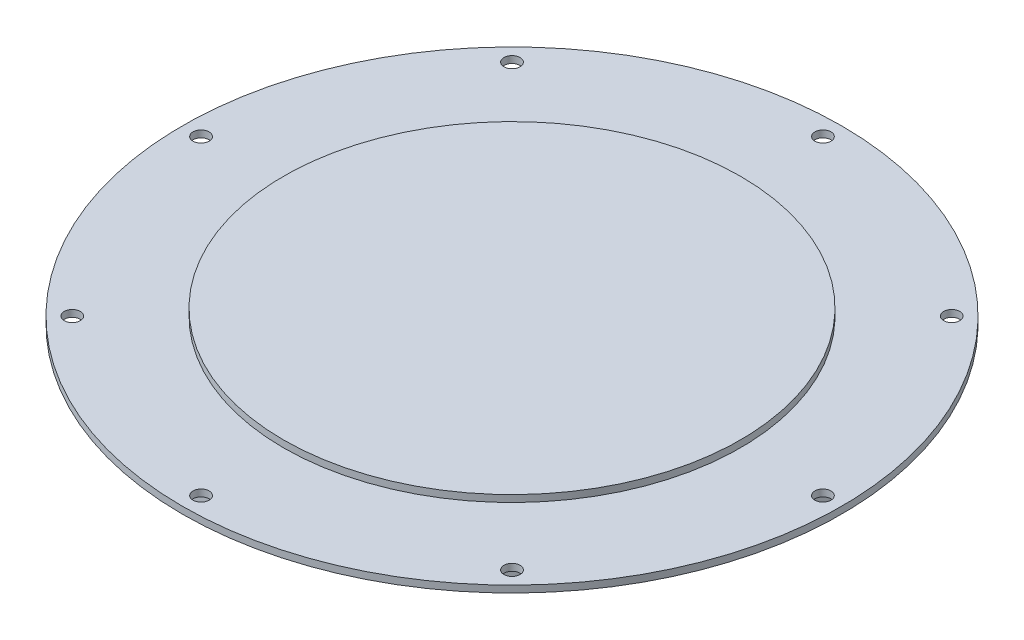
ISO-10303-21;
HEADER;
FILE_DESCRIPTION(('STEP AP214'),'2;1');
FILE_NAME('part.step','',(''),(''),'','','');
FILE_SCHEMA(('AUTOMOTIVE_DESIGN { 1 0 10303 214 1 1 1 1 }'));
ENDSEC;
DATA;
#1=APPLICATION_CONTEXT('core data for automotive mechanical design processes');
#2=APPLICATION_PROTOCOL_DEFINITION('international standard','automotive_design',2000,#1);
#3=PRODUCT_CONTEXT('',#1,'mechanical');
#4=PRODUCT('Part','Part','',(#3));
#5=PRODUCT_RELATED_PRODUCT_CATEGORY('part','',(#4));
#6=PRODUCT_DEFINITION_FORMATION('','',#4);
#7=PRODUCT_DEFINITION_CONTEXT('part definition',#1,'design');
#8=PRODUCT_DEFINITION('design','',#6,#7);
#9=PRODUCT_DEFINITION_SHAPE('','',#8);
#10=(LENGTH_UNIT() NAMED_UNIT(*) SI_UNIT(.MILLI.,.METRE.));
#11=(NAMED_UNIT(*) PLANE_ANGLE_UNIT() SI_UNIT($,.RADIAN.));
#12=(NAMED_UNIT(*) SI_UNIT($,.STERADIAN.) SOLID_ANGLE_UNIT());
#13=UNCERTAINTY_MEASURE_WITH_UNIT(LENGTH_MEASURE(1.E-05),#10,'distance_accuracy_value','');
#14=(GEOMETRIC_REPRESENTATION_CONTEXT(3) GLOBAL_UNCERTAINTY_ASSIGNED_CONTEXT((#13)) GLOBAL_UNIT_ASSIGNED_CONTEXT((#10,
#11,#12)) REPRESENTATION_CONTEXT('',''));
#15=CARTESIAN_POINT('',(0.,0.,0.));
#16=DIRECTION('',(0.,0.,1.));
#17=DIRECTION('',(1.,0.,0.));
#18=AXIS2_PLACEMENT_3D('',#15,#16,#17);
#19=CARTESIAN_POINT('',(0.,0.,0.));
#20=DIRECTION('',(0.,1.,0.));
#21=DIRECTION('',(0.,0.,1.));
#22=AXIS2_PLACEMENT_3D('',#19,#20,#21);
#23=CYLINDRICAL_SURFACE('',#22,146.05);
#24=CARTESIAN_POINT('',(0.,-3.048,0.));
#25=DIRECTION('',(0.,1.,0.));
#26=DIRECTION('',(0.,0.,1.));
#27=AXIS2_PLACEMENT_3D('',#24,#25,#26);
#28=CIRCLE('',#27,146.05);
#29=CARTESIAN_POINT('',(0.,-3.048,146.05));
#30=VERTEX_POINT('',#29);
#31=EDGE_CURVE('E112',#30,#30,#28,.T.);
#32=ORIENTED_EDGE('',*,*,#31,.T.);
#33=EDGE_LOOP('',(#32));
#34=FACE_BOUND('',#33,.T.);
#35=CARTESIAN_POINT('',(0.,0.,0.));
#36=DIRECTION('',(0.,1.,0.));
#37=DIRECTION('',(0.,0.,1.));
#38=AXIS2_PLACEMENT_3D('',#35,#36,#37);
#39=CIRCLE('',#38,146.05);
#40=CARTESIAN_POINT('',(0.,0.,146.05));
#41=VERTEX_POINT('',#40);
#42=EDGE_CURVE('E48',#41,#41,#39,.T.);
#43=ORIENTED_EDGE('',*,*,#42,.F.);
#44=EDGE_LOOP('',(#43));
#45=FACE_BOUND('',#44,.T.);
#46=ADVANCED_FACE('F35',(#34,#45),#23,.T.);
#47=CARTESIAN_POINT('',(-146.05,-3.048,0.));
#48=DIRECTION('',(0.,-1.,0.));
#49=DIRECTION('',(0.,0.,-1.));
#50=AXIS2_PLACEMENT_3D('',#47,#48,#49);
#51=PLANE('',#50);
#52=CARTESIAN_POINT('',(-97.4357789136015,-3.048,-97.4357789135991));
#53=DIRECTION('',(0.,-1.,0.));
#54=DIRECTION('',(0.,0.,-1.));
#55=AXIS2_PLACEMENT_3D('',#52,#53,#54);
#56=CIRCLE('',#55,3.571875);
#57=CARTESIAN_POINT('',(-97.4357789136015,-3.048,-101.007653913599));
#58=VERTEX_POINT('',#57);
#59=EDGE_CURVE('E84',#58,#58,#56,.T.);
#60=ORIENTED_EDGE('',*,*,#59,.F.);
#61=EDGE_LOOP('',(#60));
#62=FACE_BOUND('',#61,.T.);
#63=CARTESIAN_POINT('',(-1.44332601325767E-12,-3.048,-137.795));
#64=DIRECTION('',(0.,-1.,0.));
#65=DIRECTION('',(0.,0.,-1.));
#66=AXIS2_PLACEMENT_3D('',#63,#64,#65);
#67=CIRCLE('',#66,3.571875);
#68=CARTESIAN_POINT('',(-1.44332601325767E-12,-3.048,-141.366875));
#69=VERTEX_POINT('',#68);
#70=EDGE_CURVE('E74',#69,#69,#67,.T.);
#71=ORIENTED_EDGE('',*,*,#70,.F.);
#72=EDGE_LOOP('',(#71));
#73=FACE_BOUND('',#72,.T.);
#74=CARTESIAN_POINT('',(97.4357789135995,-3.048,-97.4357789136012));
#75=DIRECTION('',(0.,-1.,0.));
#76=DIRECTION('',(0.,0.,-1.));
#77=AXIS2_PLACEMENT_3D('',#74,#75,#76);
#78=CIRCLE('',#77,3.571875);
#79=CARTESIAN_POINT('',(97.4357789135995,-3.048,-101.007653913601));
#80=VERTEX_POINT('',#79);
#81=EDGE_CURVE('E71',#80,#80,#78,.T.);
#82=ORIENTED_EDGE('',*,*,#81,.F.);
#83=EDGE_LOOP('',(#82));
#84=FACE_BOUND('',#83,.T.);
#85=CARTESIAN_POINT('',(137.795,-3.048,0.));
#86=DIRECTION('',(0.,-1.,0.));
#87=DIRECTION('',(0.,0.,-1.));
#88=AXIS2_PLACEMENT_3D('',#85,#86,#87);
#89=CIRCLE('',#88,3.571875);
#90=CARTESIAN_POINT('',(137.795,-3.048,-3.571875));
#91=VERTEX_POINT('',#90);
#92=EDGE_CURVE('E68',#91,#91,#89,.T.);
#93=ORIENTED_EDGE('',*,*,#92,.F.);
#94=EDGE_LOOP('',(#93));
#95=FACE_BOUND('',#94,.T.);
#96=CARTESIAN_POINT('',(97.4357789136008,-3.048,97.4357789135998));
#97=DIRECTION('',(0.,-1.,0.));
#98=DIRECTION('',(0.,0.,-1.));
#99=AXIS2_PLACEMENT_3D('',#96,#97,#98);
#100=CIRCLE('',#99,3.571875);
#101=CARTESIAN_POINT('',(97.4357789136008,-3.048,93.8639039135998));
#102=VERTEX_POINT('',#101);
#103=EDGE_CURVE('E64',#102,#102,#100,.T.);
#104=ORIENTED_EDGE('',*,*,#103,.F.);
#105=EDGE_LOOP('',(#104));
#106=FACE_BOUND('',#105,.T.);
#107=CARTESIAN_POINT('',(4.8110867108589E-13,-3.048,137.795));
#108=DIRECTION('',(0.,-1.,0.));
#109=DIRECTION('',(0.,0.,-1.));
#110=AXIS2_PLACEMENT_3D('',#107,#108,#109);
#111=CIRCLE('',#110,3.571875);
#112=CARTESIAN_POINT('',(4.8110867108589E-13,-3.048,134.223125));
#113=VERTEX_POINT('',#112);
#114=EDGE_CURVE('E60',#113,#113,#111,.T.);
#115=ORIENTED_EDGE('',*,*,#114,.F.);
#116=EDGE_LOOP('',(#115));
#117=FACE_BOUND('',#116,.T.);
#118=CARTESIAN_POINT('',(-97.4357789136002,-3.048,97.4357789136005));
#119=DIRECTION('',(0.,-1.,0.));
#120=DIRECTION('',(0.,0.,-1.));
#121=AXIS2_PLACEMENT_3D('',#118,#119,#120);
#122=CIRCLE('',#121,3.571875);
#123=CARTESIAN_POINT('',(-97.4357789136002,-3.048,93.8639039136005));
#124=VERTEX_POINT('',#123);
#125=EDGE_CURVE('E56',#124,#124,#122,.T.);
#126=ORIENTED_EDGE('',*,*,#125,.F.);
#127=EDGE_LOOP('',(#126));
#128=FACE_BOUND('',#127,.T.);
#129=CARTESIAN_POINT('',(-137.795,-3.048,0.));
#130=DIRECTION('',(0.,-1.,0.));
#131=DIRECTION('',(0.,0.,-1.));
#132=AXIS2_PLACEMENT_3D('',#129,#130,#131);
#133=CIRCLE('',#132,3.571875);
#134=CARTESIAN_POINT('',(-137.795,-3.048,-3.571875));
#135=VERTEX_POINT('',#134);
#136=EDGE_CURVE('E55',#135,#135,#133,.T.);
#137=ORIENTED_EDGE('',*,*,#136,.F.);
#138=EDGE_LOOP('',(#137));
#139=FACE_BOUND('',#138,.T.);
#140=CARTESIAN_POINT('',(0.,-3.048,0.));
#141=DIRECTION('',(0.,1.,0.));
#142=DIRECTION('',(0.,0.,1.));
#143=AXIS2_PLACEMENT_3D('',#140,#141,#142);
#144=CIRCLE('',#143,127.);
#145=CARTESIAN_POINT('',(0.,-3.048,127.));
#146=VERTEX_POINT('',#145);
#147=EDGE_CURVE('E109',#146,#146,#144,.T.);
#148=ORIENTED_EDGE('',*,*,#147,.T.);
#149=EDGE_LOOP('',(#148));
#150=FACE_BOUND('',#149,.T.);
#151=ORIENTED_EDGE('',*,*,#31,.F.);
#152=EDGE_LOOP('',(#151));
#153=FACE_BOUND('',#152,.T.);
#154=ADVANCED_FACE('F120',(#62,#73,#84,#95,#106,#117,#128,#139,#150,#153),#51,.T.);
#155=CARTESIAN_POINT('',(0.,0.,0.));
#156=DIRECTION('',(0.,1.,0.));
#157=DIRECTION('',(0.,0.,1.));
#158=AXIS2_PLACEMENT_3D('',#155,#156,#157);
#159=CYLINDRICAL_SURFACE('',#158,127.);
#160=CARTESIAN_POINT('',(0.,-15.748,0.));
#161=DIRECTION('',(0.,1.,0.));
#162=DIRECTION('',(0.,0.,1.));
#163=AXIS2_PLACEMENT_3D('',#160,#161,#162);
#164=CIRCLE('',#163,127.);
#165=CARTESIAN_POINT('',(0.,-15.748,127.));
#166=VERTEX_POINT('',#165);
#167=EDGE_CURVE('E106',#166,#166,#164,.T.);
#168=ORIENTED_EDGE('',*,*,#167,.T.);
#169=EDGE_LOOP('',(#168));
#170=FACE_BOUND('',#169,.T.);
#171=ORIENTED_EDGE('',*,*,#147,.F.);
#172=EDGE_LOOP('',(#171));
#173=FACE_BOUND('',#172,.T.);
#174=ADVANCED_FACE('F126',(#170,#173),#159,.T.);
#175=CARTESIAN_POINT('',(-127.,-15.748,0.));
#176=DIRECTION('',(0.,-1.,0.));
#177=DIRECTION('',(0.,0.,-1.));
#178=AXIS2_PLACEMENT_3D('',#175,#176,#177);
#179=PLANE('',#178);
#180=CARTESIAN_POINT('',(0.,-15.748,0.));
#181=DIRECTION('',(0.,1.,0.));
#182=DIRECTION('',(0.,0.,1.));
#183=AXIS2_PLACEMENT_3D('',#180,#181,#182);
#184=CIRCLE('',#183,125.73);
#185=CARTESIAN_POINT('',(0.,-15.748,125.73));
#186=VERTEX_POINT('',#185);
#187=EDGE_CURVE('E103',#186,#186,#184,.T.);
#188=ORIENTED_EDGE('',*,*,#187,.T.);
#189=EDGE_LOOP('',(#188));
#190=FACE_BOUND('',#189,.T.);
#191=ORIENTED_EDGE('',*,*,#167,.F.);
#192=EDGE_LOOP('',(#191));
#193=FACE_BOUND('',#192,.T.);
#194=ADVANCED_FACE('F174',(#190,#193),#179,.T.);
#195=CARTESIAN_POINT('',(0.,-15.748,0.));
#196=DIRECTION('',(0.,-1.,0.));
#197=DIRECTION('',(0.,0.,-1.));
#198=AXIS2_PLACEMENT_3D('',#195,#196,#197);
#199=CONICAL_SURFACE('',#198,125.73,1.52534725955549);
#200=CARTESIAN_POINT('',(0.,-14.732,0.));
#201=DIRECTION('',(0.,1.,0.));
#202=DIRECTION('',(0.,0.,1.));
#203=AXIS2_PLACEMENT_3D('',#200,#201,#202);
#204=CIRCLE('',#203,103.3907);
#205=CARTESIAN_POINT('',(0.,-14.732,103.3907));
#206=VERTEX_POINT('',#205);
#207=EDGE_CURVE('E100',#206,#206,#204,.T.);
#208=ORIENTED_EDGE('',*,*,#207,.T.);
#209=EDGE_LOOP('',(#208));
#210=FACE_BOUND('',#209,.T.);
#211=ORIENTED_EDGE('',*,*,#187,.F.);
#212=EDGE_LOOP('',(#211));
#213=FACE_BOUND('',#212,.T.);
#214=ADVANCED_FACE('F135',(#210,#213),#199,.F.);
#215=CARTESIAN_POINT('',(0.,3.04800000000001,0.));
#216=DIRECTION('',(0.,-1.,0.));
#217=DIRECTION('',(0.,0.,-1.));
#218=AXIS2_PLACEMENT_3D('',#215,#216,#217);
#219=PLANE('',#218);
#220=CARTESIAN_POINT('',(0.,3.048,0.));
#221=DIRECTION('',(0.,-1.,0.));
#222=DIRECTION('',(0.,0.,-1.));
#223=AXIS2_PLACEMENT_3D('',#220,#221,#222);
#224=CIRCLE('',#223,101.2317);
#225=CARTESIAN_POINT('',(0.,3.048,-101.2317));
#226=VERTEX_POINT('',#225);
#227=EDGE_CURVE('E43',#226,#226,#224,.T.);
#228=ORIENTED_EDGE('',*,*,#227,.F.);
#229=EDGE_LOOP('',(#228));
#230=FACE_BOUND('',#229,.T.);
#231=ADVANCED_FACE('F131',(#230),#219,.F.);
#232=CARTESIAN_POINT('',(0.,3.04800000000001,0.));
#233=DIRECTION('',(0.,-1.,0.));
#234=DIRECTION('',(0.,0.,-1.));
#235=AXIS2_PLACEMENT_3D('',#232,#233,#234);
#236=CYLINDRICAL_SURFACE('',#235,101.2317);
#237=CARTESIAN_POINT('',(0.,0.,0.));
#238=DIRECTION('',(0.,-1.,0.));
#239=DIRECTION('',(0.,0.,-1.));
#240=AXIS2_PLACEMENT_3D('',#237,#238,#239);
#241=CIRCLE('',#240,101.2317);
#242=CARTESIAN_POINT('',(0.,0.,-101.2317));
#243=VERTEX_POINT('',#242);
#244=EDGE_CURVE('E10',#243,#243,#241,.T.);
#245=ORIENTED_EDGE('',*,*,#244,.F.);
#246=EDGE_LOOP('',(#245));
#247=FACE_BOUND('',#246,.T.);
#248=ORIENTED_EDGE('',*,*,#227,.T.);
#249=EDGE_LOOP('',(#248));
#250=FACE_BOUND('',#249,.T.);
#251=ADVANCED_FACE('F134',(#247,#250),#236,.T.);
#252=CARTESIAN_POINT('',(-101.2317,0.,0.));
#253=DIRECTION('',(0.,-1.,0.));
#254=DIRECTION('',(0.,0.,-1.));
#255=AXIS2_PLACEMENT_3D('',#252,#253,#254);
#256=PLANE('',#255);
#257=CARTESIAN_POINT('',(-97.4357789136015,0.,-97.4357789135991));
#258=DIRECTION('',(0.,-1.,0.));
#259=DIRECTION('',(0.,0.,-1.));
#260=AXIS2_PLACEMENT_3D('',#257,#258,#259);
#261=CIRCLE('',#260,3.571875);
#262=CARTESIAN_POINT('',(-97.4357789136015,0.,-101.007653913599));
#263=VERTEX_POINT('',#262);
#264=EDGE_CURVE('E39',#263,#263,#261,.T.);
#265=ORIENTED_EDGE('',*,*,#264,.T.);
#266=EDGE_LOOP('',(#265));
#267=FACE_BOUND('',#266,.T.);
#268=CARTESIAN_POINT('',(-1.44332601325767E-12,0.,-137.795));
#269=DIRECTION('',(0.,-1.,0.));
#270=DIRECTION('',(0.,0.,-1.));
#271=AXIS2_PLACEMENT_3D('',#268,#269,#270);
#272=CIRCLE('',#271,3.57187499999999);
#273=CARTESIAN_POINT('',(-1.44332601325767E-12,0.,-141.366875));
#274=VERTEX_POINT('',#273);
#275=EDGE_CURVE('E72',#274,#274,#272,.T.);
#276=ORIENTED_EDGE('',*,*,#275,.T.);
#277=EDGE_LOOP('',(#276));
#278=FACE_BOUND('',#277,.T.);
#279=CARTESIAN_POINT('',(97.4357789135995,0.,-97.4357789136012));
#280=DIRECTION('',(0.,-1.,0.));
#281=DIRECTION('',(0.,0.,-1.));
#282=AXIS2_PLACEMENT_3D('',#279,#280,#281);
#283=CIRCLE('',#282,3.571875);
#284=CARTESIAN_POINT('',(97.4357789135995,0.,-101.007653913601));
#285=VERTEX_POINT('',#284);
#286=EDGE_CURVE('E69',#285,#285,#283,.T.);
#287=ORIENTED_EDGE('',*,*,#286,.T.);
#288=EDGE_LOOP('',(#287));
#289=FACE_BOUND('',#288,.T.);
#290=CARTESIAN_POINT('',(137.795,0.,0.));
#291=DIRECTION('',(0.,-1.,0.));
#292=DIRECTION('',(0.,0.,-1.));
#293=AXIS2_PLACEMENT_3D('',#290,#291,#292);
#294=CIRCLE('',#293,3.57187499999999);
#295=CARTESIAN_POINT('',(137.795,0.,-3.57187499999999));
#296=VERTEX_POINT('',#295);
#297=EDGE_CURVE('E65',#296,#296,#294,.T.);
#298=ORIENTED_EDGE('',*,*,#297,.T.);
#299=EDGE_LOOP('',(#298));
#300=FACE_BOUND('',#299,.T.);
#301=CARTESIAN_POINT('',(97.4357789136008,0.,97.4357789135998));
#302=DIRECTION('',(0.,-1.,0.));
#303=DIRECTION('',(0.,0.,-1.));
#304=AXIS2_PLACEMENT_3D('',#301,#302,#303);
#305=CIRCLE('',#304,3.571875);
#306=CARTESIAN_POINT('',(97.4357789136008,0.,93.8639039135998));
#307=VERTEX_POINT('',#306);
#308=EDGE_CURVE('E61',#307,#307,#305,.T.);
#309=ORIENTED_EDGE('',*,*,#308,.T.);
#310=EDGE_LOOP('',(#309));
#311=FACE_BOUND('',#310,.T.);
#312=CARTESIAN_POINT('',(4.8110867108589E-13,0.,137.795));
#313=DIRECTION('',(0.,-1.,0.));
#314=DIRECTION('',(0.,0.,-1.));
#315=AXIS2_PLACEMENT_3D('',#312,#313,#314);
#316=CIRCLE('',#315,3.57187499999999);
#317=CARTESIAN_POINT('',(4.8110867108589E-13,0.,134.223125));
#318=VERTEX_POINT('',#317);
#319=EDGE_CURVE('E57',#318,#318,#316,.T.);
#320=ORIENTED_EDGE('',*,*,#319,.T.);
#321=EDGE_LOOP('',(#320));
#322=FACE_BOUND('',#321,.T.);
#323=CARTESIAN_POINT('',(-97.4357789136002,0.,97.4357789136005));
#324=DIRECTION('',(0.,-1.,0.));
#325=DIRECTION('',(0.,0.,-1.));
#326=AXIS2_PLACEMENT_3D('',#323,#324,#325);
#327=CIRCLE('',#326,3.571875);
#328=CARTESIAN_POINT('',(-97.4357789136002,0.,93.8639039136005));
#329=VERTEX_POINT('',#328);
#330=EDGE_CURVE('E52',#329,#329,#327,.T.);
#331=ORIENTED_EDGE('',*,*,#330,.T.);
#332=EDGE_LOOP('',(#331));
#333=FACE_BOUND('',#332,.T.);
#334=CARTESIAN_POINT('',(-137.795,0.,0.));
#335=DIRECTION('',(0.,-1.,0.));
#336=DIRECTION('',(0.,0.,-1.));
#337=AXIS2_PLACEMENT_3D('',#334,#335,#336);
#338=CIRCLE('',#337,3.57187499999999);
#339=CARTESIAN_POINT('',(-137.795,0.,-3.57187499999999));
#340=VERTEX_POINT('',#339);
#341=EDGE_CURVE('E97',#340,#340,#338,.T.);
#342=ORIENTED_EDGE('',*,*,#341,.T.);
#343=EDGE_LOOP('',(#342));
#344=FACE_BOUND('',#343,.T.);
#345=ORIENTED_EDGE('',*,*,#244,.T.);
#346=EDGE_LOOP('',(#345));
#347=FACE_BOUND('',#346,.T.);
#348=ORIENTED_EDGE('',*,*,#42,.T.);
#349=EDGE_LOOP('',(#348));
#350=FACE_BOUND('',#349,.T.);
#351=ADVANCED_FACE('F117',(#267,#278,#289,#300,#311,#322,#333,#344,#347,#350),#256,.F.);
#352=CARTESIAN_POINT('',(-109.5375,-14.732,0.));
#353=DIRECTION('',(0.,1.,0.));
#354=DIRECTION('',(0.,0.,1.));
#355=AXIS2_PLACEMENT_3D('',#352,#353,#354);
#356=PLANE('',#355);
#357=ORIENTED_EDGE('',*,*,#207,.F.);
#358=EDGE_LOOP('',(#357));
#359=FACE_BOUND('',#358,.T.);
#360=ADVANCED_FACE('F37',(#359),#356,.F.);
#361=CARTESIAN_POINT('',(-137.795,-3.048,0.));
#362=DIRECTION('',(0.,-1.,0.));
#363=DIRECTION('',(0.,0.,-1.));
#364=AXIS2_PLACEMENT_3D('',#361,#362,#363);
#365=CYLINDRICAL_SURFACE('',#364,3.57187499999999);
#366=ORIENTED_EDGE('',*,*,#136,.T.);
#367=EDGE_LOOP('',(#366));
#368=FACE_BOUND('',#367,.T.);
#369=ORIENTED_EDGE('',*,*,#341,.F.);
#370=EDGE_LOOP('',(#369));
#371=FACE_BOUND('',#370,.T.);
#372=ADVANCED_FACE('F144',(#368,#371),#365,.F.);
#373=CARTESIAN_POINT('',(-97.4357789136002,-3.048,97.4357789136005));
#374=DIRECTION('',(0.,-1.,0.));
#375=DIRECTION('',(0.,0.,-1.));
#376=AXIS2_PLACEMENT_3D('',#373,#374,#375);
#377=CYLINDRICAL_SURFACE('',#376,3.571875);
#378=ORIENTED_EDGE('',*,*,#125,.T.);
#379=EDGE_LOOP('',(#378));
#380=FACE_BOUND('',#379,.T.);
#381=ORIENTED_EDGE('',*,*,#330,.F.);
#382=EDGE_LOOP('',(#381));
#383=FACE_BOUND('',#382,.T.);
#384=ADVANCED_FACE('F161',(#380,#383),#377,.F.);
#385=CARTESIAN_POINT('',(4.8110867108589E-13,-3.048,137.795));
#386=DIRECTION('',(0.,-1.,0.));
#387=DIRECTION('',(0.,0.,-1.));
#388=AXIS2_PLACEMENT_3D('',#385,#386,#387);
#389=CYLINDRICAL_SURFACE('',#388,3.57187499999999);
#390=ORIENTED_EDGE('',*,*,#114,.T.);
#391=EDGE_LOOP('',(#390));
#392=FACE_BOUND('',#391,.T.);
#393=ORIENTED_EDGE('',*,*,#319,.F.);
#394=EDGE_LOOP('',(#393));
#395=FACE_BOUND('',#394,.T.);
#396=ADVANCED_FACE('F167',(#392,#395),#389,.F.);
#397=CARTESIAN_POINT('',(97.4357789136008,-3.048,97.4357789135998));
#398=DIRECTION('',(0.,-1.,0.));
#399=DIRECTION('',(0.,0.,-1.));
#400=AXIS2_PLACEMENT_3D('',#397,#398,#399);
#401=CYLINDRICAL_SURFACE('',#400,3.571875);
#402=ORIENTED_EDGE('',*,*,#103,.T.);
#403=EDGE_LOOP('',(#402));
#404=FACE_BOUND('',#403,.T.);
#405=ORIENTED_EDGE('',*,*,#308,.F.);
#406=EDGE_LOOP('',(#405));
#407=FACE_BOUND('',#406,.T.);
#408=ADVANCED_FACE('F251',(#404,#407),#401,.F.);
#409=CARTESIAN_POINT('',(137.795,-3.048,0.));
#410=DIRECTION('',(0.,-1.,0.));
#411=DIRECTION('',(0.,0.,-1.));
#412=AXIS2_PLACEMENT_3D('',#409,#410,#411);
#413=CYLINDRICAL_SURFACE('',#412,3.57187499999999);
#414=ORIENTED_EDGE('',*,*,#92,.T.);
#415=EDGE_LOOP('',(#414));
#416=FACE_BOUND('',#415,.T.);
#417=ORIENTED_EDGE('',*,*,#297,.F.);
#418=EDGE_LOOP('',(#417));
#419=FACE_BOUND('',#418,.T.);
#420=ADVANCED_FACE('F259',(#416,#419),#413,.F.);
#421=CARTESIAN_POINT('',(97.4357789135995,-3.048,-97.4357789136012));
#422=DIRECTION('',(0.,-1.,0.));
#423=DIRECTION('',(0.,0.,-1.));
#424=AXIS2_PLACEMENT_3D('',#421,#422,#423);
#425=CYLINDRICAL_SURFACE('',#424,3.571875);
#426=ORIENTED_EDGE('',*,*,#81,.T.);
#427=EDGE_LOOP('',(#426));
#428=FACE_BOUND('',#427,.T.);
#429=ORIENTED_EDGE('',*,*,#286,.F.);
#430=EDGE_LOOP('',(#429));
#431=FACE_BOUND('',#430,.T.);
#432=ADVANCED_FACE('F268',(#428,#431),#425,.F.);
#433=CARTESIAN_POINT('',(-1.44332601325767E-12,-3.048,-137.795));
#434=DIRECTION('',(0.,-1.,0.));
#435=DIRECTION('',(0.,0.,-1.));
#436=AXIS2_PLACEMENT_3D('',#433,#434,#435);
#437=CYLINDRICAL_SURFACE('',#436,3.57187499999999);
#438=ORIENTED_EDGE('',*,*,#70,.T.);
#439=EDGE_LOOP('',(#438));
#440=FACE_BOUND('',#439,.T.);
#441=ORIENTED_EDGE('',*,*,#275,.F.);
#442=EDGE_LOOP('',(#441));
#443=FACE_BOUND('',#442,.T.);
#444=ADVANCED_FACE('F277',(#440,#443),#437,.F.);
#445=CARTESIAN_POINT('',(-97.4357789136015,-3.048,-97.4357789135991));
#446=DIRECTION('',(0.,-1.,0.));
#447=DIRECTION('',(0.,0.,-1.));
#448=AXIS2_PLACEMENT_3D('',#445,#446,#447);
#449=CYLINDRICAL_SURFACE('',#448,3.571875);
#450=ORIENTED_EDGE('',*,*,#59,.T.);
#451=EDGE_LOOP('',(#450));
#452=FACE_BOUND('',#451,.T.);
#453=ORIENTED_EDGE('',*,*,#264,.F.);
#454=EDGE_LOOP('',(#453));
#455=FACE_BOUND('',#454,.T.);
#456=ADVANCED_FACE('F286',(#452,#455),#449,.F.);
#457=CLOSED_SHELL('',(#46,#154,#174,#194,#214,#231,#251,#351,#360,#372,#384,#396,#408,#420,#432,
#444,#456));
#458=MANIFOLD_SOLID_BREP('B2',#457);
#459=ADVANCED_BREP_SHAPE_REPRESENTATION('',(#18,#458),#14);
#460=SHAPE_DEFINITION_REPRESENTATION(#9,#459);
ENDSEC;
END-ISO-10303-21;
